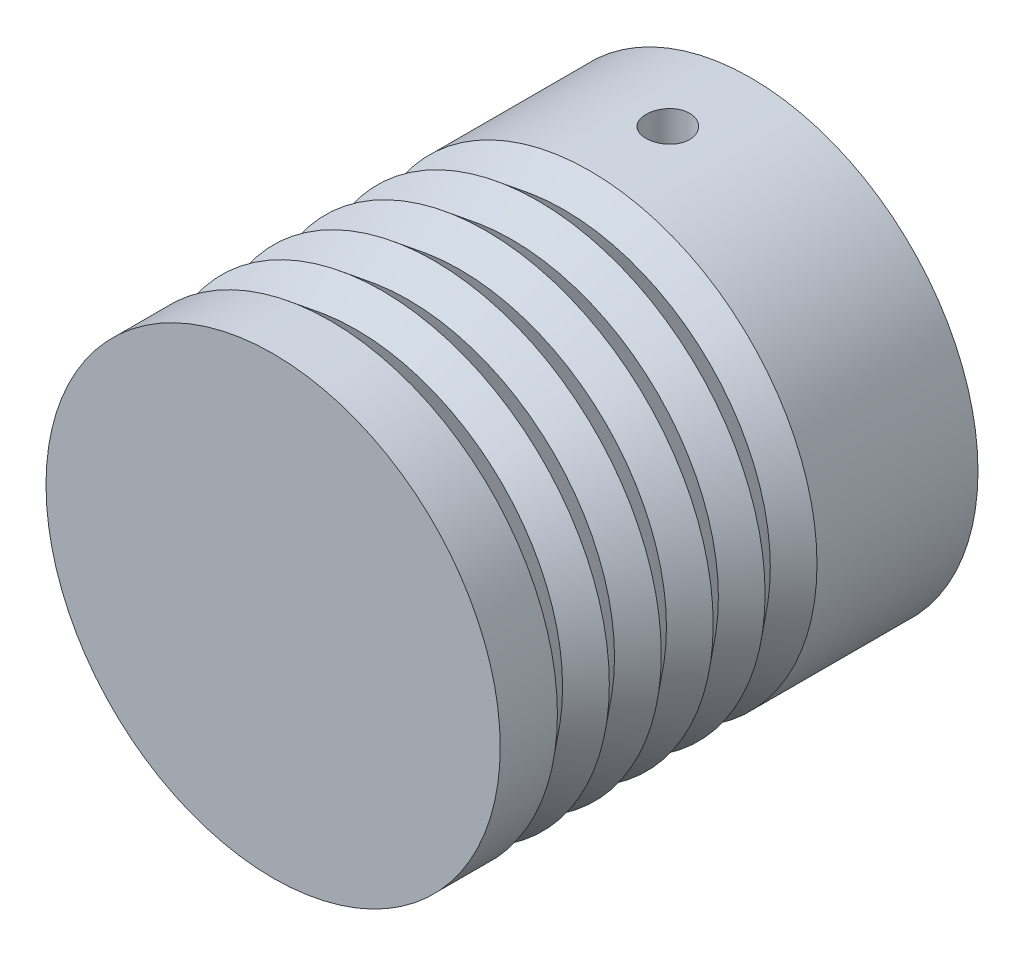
ISO-10303-21;
HEADER;
FILE_DESCRIPTION(('STEP AP214'),'2;1');
FILE_NAME('part.step','',(''),(''),'','','');
FILE_SCHEMA(('AUTOMOTIVE_DESIGN { 1 0 10303 214 1 1 1 1 }'));
ENDSEC;
DATA;
#1=APPLICATION_CONTEXT('core data for automotive mechanical design processes');
#2=APPLICATION_PROTOCOL_DEFINITION('international standard','automotive_design',2000,#1);
#3=PRODUCT_CONTEXT('',#1,'mechanical');
#4=PRODUCT('Part','Part','',(#3));
#5=PRODUCT_RELATED_PRODUCT_CATEGORY('part','',(#4));
#6=PRODUCT_DEFINITION_FORMATION('','',#4);
#7=PRODUCT_DEFINITION_CONTEXT('part definition',#1,'design');
#8=PRODUCT_DEFINITION('design','',#6,#7);
#9=PRODUCT_DEFINITION_SHAPE('','',#8);
#10=(LENGTH_UNIT() NAMED_UNIT(*) SI_UNIT(.MILLI.,.METRE.));
#11=(NAMED_UNIT(*) PLANE_ANGLE_UNIT() SI_UNIT($,.RADIAN.));
#12=(NAMED_UNIT(*) SI_UNIT($,.STERADIAN.) SOLID_ANGLE_UNIT());
#13=UNCERTAINTY_MEASURE_WITH_UNIT(LENGTH_MEASURE(1.E-05),#10,'distance_accuracy_value','');
#14=(GEOMETRIC_REPRESENTATION_CONTEXT(3) GLOBAL_UNCERTAINTY_ASSIGNED_CONTEXT((#13)) GLOBAL_UNIT_ASSIGNED_CONTEXT((#10,
#11,#12)) REPRESENTATION_CONTEXT('',''));
#15=CARTESIAN_POINT('',(0.,0.,0.));
#16=DIRECTION('',(0.,0.,1.));
#17=DIRECTION('',(1.,0.,0.));
#18=AXIS2_PLACEMENT_3D('',#15,#16,#17);
#19=CARTESIAN_POINT('',(2.43215268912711E-05,-1.12921142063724E-06,2.66313744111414));
#20=DIRECTION('',(1.8833914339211E-07,-2.44001352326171E-13,-0.999999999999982));
#21=DIRECTION('',(-0.999999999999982,0.,-1.8833914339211E-07));
#22=AXIS2_PLACEMENT_3D('',#19,#20,#21);
#23=CONICAL_SURFACE('',#22,15.0370018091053,0.674740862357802);
#24=CARTESIAN_POINT('',(2.43215732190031E-05,-1.12921010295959E-06,2.66355047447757));
#25=DIRECTION('',(-1.88342028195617E-07,3.34700908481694E-13,-0.999999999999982));
#26=DIRECTION('',(-0.999999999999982,-2.3657708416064E-13,1.88342028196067E-07));
#27=AXIS2_PLACEMENT_3D('',#24,#25,#26);
#28=CIRCLE('',#27,15.0373276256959);
#29=CARTESIAN_POINT('',(-15.0373033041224,-1.12921366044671E-06,2.66355330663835));
#30=VERTEX_POINT('',#29);
#31=EDGE_CURVE('E12',#30,#30,#28,.T.);
#32=ORIENTED_EDGE('',*,*,#31,.F.);
#33=EDGE_LOOP('',(#32));
#34=FACE_BOUND('',#33,.T.);
#35=CARTESIAN_POINT('',(2.39979061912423E-05,-1.12920194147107E-06,4.38231071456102));
#36=DIRECTION('',(1.88338518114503E-07,-9.4754163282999E-13,0.999999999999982));
#37=DIRECTION('',(0.999999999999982,0.,-1.88338518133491E-07));
#38=AXIS2_PLACEMENT_3D('',#35,#36,#37);
#39=CIRCLE('',#38,13.6623361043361);
#40=CARTESIAN_POINT('',(13.662360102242,-1.12920194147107E-06,4.38230814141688));
#41=VERTEX_POINT('',#40);
#42=EDGE_CURVE('E359',#41,#41,#39,.T.);
#43=ORIENTED_EDGE('',*,*,#42,.F.);
#44=EDGE_LOOP('',(#43));
#45=FACE_BOUND('',#44,.T.);
#46=ADVANCED_FACE('F62',(#34,#45),#23,.T.);
#47=CARTESIAN_POINT('',(2.43215203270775E-05,-1.12921291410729E-06,-0.774362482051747));
#48=DIRECTION('',(1.88339782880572E-07,0.,-0.999999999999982));
#49=DIRECTION('',(-0.999999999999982,0.,-1.88339782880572E-07));
#50=AXIS2_PLACEMENT_3D('',#47,#48,#49);
#51=CONICAL_SURFACE('',#50,15.0370018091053,0.674740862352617);
#52=CARTESIAN_POINT('',(2.43216081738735E-05,-1.12921098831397E-06,-0.773949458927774));
#53=DIRECTION('',(-1.88338717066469E-07,2.6958808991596E-13,-0.999999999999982));
#54=DIRECTION('',(-0.999999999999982,-1.78845486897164E-13,1.88338717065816E-07));
#55=AXIS2_PLACEMENT_3D('',#52,#53,#54);
#56=CIRCLE('',#55,15.0373276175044);
#57=CARTESIAN_POINT('',(-15.0373032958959,-1.12921367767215E-06,-0.773946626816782));
#58=VERTEX_POINT('',#57);
#59=EDGE_CURVE('E88',#58,#58,#56,.T.);
#60=ORIENTED_EDGE('',*,*,#59,.F.);
#61=EDGE_LOOP('',(#60));
#62=FACE_BOUND('',#61,.T.);
#63=CARTESIAN_POINT('',(2.39978622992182E-05,-1.12920952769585E-06,0.944810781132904));
#64=DIRECTION('',(1.88342028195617E-07,-3.34700908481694E-13,0.999999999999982));
#65=DIRECTION('',(0.999999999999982,0.,-1.88342028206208E-07));
#66=AXIS2_PLACEMENT_3D('',#63,#64,#65);
#67=CIRCLE('',#66,13.6623360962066);
#68=CARTESIAN_POINT('',(13.6623600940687,-1.12920952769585E-06,0.944808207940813));
#69=VERTEX_POINT('',#68);
#70=EDGE_CURVE('E168',#69,#69,#67,.T.);
#71=ORIENTED_EDGE('',*,*,#70,.F.);
#72=EDGE_LOOP('',(#71));
#73=FACE_BOUND('',#72,.T.);
#74=ADVANCED_FACE('F123',(#62,#73),#51,.T.);
#75=CARTESIAN_POINT('',(2.43215691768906E-05,-1.12921979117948E-06,-4.21186240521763));
#76=DIRECTION('',(1.88335249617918E-07,5.79273716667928E-13,-0.999999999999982));
#77=DIRECTION('',(-0.999999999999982,0.,-1.88335249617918E-07));
#78=AXIS2_PLACEMENT_3D('',#75,#76,#77);
#79=CONICAL_SURFACE('',#78,15.0370018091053,0.674740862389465);
#80=CARTESIAN_POINT('',(2.43216568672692E-05,-1.12920847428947E-06,-4.21144939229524));
#81=DIRECTION('',(-1.88334198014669E-07,4.8027949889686E-13,-0.999999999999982));
#82=DIRECTION('',(-0.999999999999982,-3.45378940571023E-13,1.88334198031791E-07));
#83=AXIS2_PLACEMENT_3D('',#80,#81,#82);
#84=CIRCLE('',#83,15.0373276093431);
#85=CARTESIAN_POINT('',(-15.037303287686,-1.12921366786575E-06,-4.2114465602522));
#86=VERTEX_POINT('',#85);
#87=EDGE_CURVE('E76',#86,#86,#84,.T.);
#88=ORIENTED_EDGE('',*,*,#87,.F.);
#89=EDGE_LOOP('',(#88));
#90=FACE_BOUND('',#89,.T.);
#91=CARTESIAN_POINT('',(2.39979029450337E-05,-1.12921052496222E-06,-2.49268915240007));
#92=DIRECTION('',(1.88338717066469E-07,-2.6958808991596E-13,0.999999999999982));
#93=DIRECTION('',(0.999999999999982,0.,-1.88338717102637E-07));
#94=AXIS2_PLACEMENT_3D('',#91,#92,#93);
#95=CIRCLE('',#94,13.662336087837);
#96=CARTESIAN_POINT('',(13.6623600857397,-1.12921052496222E-06,-2.49269172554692));
#97=VERTEX_POINT('',#96);
#98=EDGE_CURVE('E322',#97,#97,#95,.T.);
#99=ORIENTED_EDGE('',*,*,#98,.F.);
#100=EDGE_LOOP('',(#99));
#101=FACE_BOUND('',#100,.T.);
#102=ADVANCED_FACE('F129',(#90,#101),#79,.T.);
#103=CARTESIAN_POINT('',(2.43215797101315E-05,-1.12923128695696E-06,-7.64936232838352));
#104=DIRECTION('',(1.88334283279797E-07,1.62908434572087E-12,-0.999999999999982));
#105=DIRECTION('',(-0.999999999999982,0.,-1.88334283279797E-07));
#106=AXIS2_PLACEMENT_3D('',#103,#104,#105);
#107=CONICAL_SURFACE('',#106,15.0370018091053,0.674740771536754);
#108=CARTESIAN_POINT('',(2.63656765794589E-05,-1.12921349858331E-06,-7.64747821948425));
#109=DIRECTION('',(0.,0.,-1.));
#110=DIRECTION('',(-1.,0.,0.));
#111=AXIS2_PLACEMENT_3D('',#108,#109,#110);
#112=CIRCLE('',#111,15.0344251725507);
#113=CARTESIAN_POINT('',(-15.0343988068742,-1.12921367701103E-06,-7.64747821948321));
#114=VERTEX_POINT('',#113);
#115=EDGE_CURVE('E94',#114,#114,#112,.T.);
#116=ORIENTED_EDGE('',*,*,#115,.F.);
#117=EDGE_LOOP('',(#116));
#118=FACE_BOUND('',#117,.T.);
#119=CARTESIAN_POINT('',(2.39979594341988E-05,-1.1292076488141E-06,-5.9301889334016));
#120=DIRECTION('',(1.88334198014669E-07,-4.8027949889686E-13,0.999999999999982));
#121=DIRECTION('',(0.999999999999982,0.,-1.88334198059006E-07));
#122=AXIS2_PLACEMENT_3D('',#119,#120,#121);
#123=CIRCLE('',#122,13.6623362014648);
#124=CARTESIAN_POINT('',(13.662360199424,-1.1292076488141E-06,-5.93019150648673));
#125=VERTEX_POINT('',#124);
#126=EDGE_CURVE('E220',#125,#125,#123,.T.);
#127=ORIENTED_EDGE('',*,*,#126,.F.);
#128=EDGE_LOOP('',(#127));
#129=FACE_BOUND('',#128,.T.);
#130=ADVANCED_FACE('F192',(#118,#129),#107,.T.);
#131=CARTESIAN_POINT('',(2.43216424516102E-05,-1.12922691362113E-06,6.10063736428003));
#132=DIRECTION('',(1.883284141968E-07,1.26504893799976E-12,-0.999999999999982));
#133=DIRECTION('',(-0.999999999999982,0.,-1.883284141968E-07));
#134=AXIS2_PLACEMENT_3D('',#131,#132,#133);
#135=CONICAL_SURFACE('',#134,15.0370018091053,0.674740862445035);
#136=CARTESIAN_POINT('',(2.39975932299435E-05,-1.12922616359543E-06,7.81981052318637));
#137=DIRECTION('',(1.88363657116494E-07,9.97680453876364E-13,0.999999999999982));
#138=DIRECTION('',(0.999999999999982,0.,-1.88363657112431E-07));
#139=AXIS2_PLACEMENT_3D('',#136,#137,#138);
#140=CIRCLE('',#139,13.6623362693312);
#141=CARTESIAN_POINT('',(13.6623602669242,-1.12922616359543E-06,7.81980794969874));
#142=VERTEX_POINT('',#141);
#143=EDGE_CURVE('E233',#142,#142,#140,.T.);
#144=ORIENTED_EDGE('',*,*,#143,.F.);
#145=EDGE_LOOP('',(#144));
#146=FACE_BOUND('',#145,.T.);
#147=CARTESIAN_POINT('',(2.43216110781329E-05,-1.12920357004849E-06,6.10105040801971));
#148=DIRECTION('',(-1.88338518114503E-07,9.4754163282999E-13,-0.999999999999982));
#149=DIRECTION('',(-0.999999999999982,-6.71784509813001E-13,1.88338518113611E-07));
#150=AXIS2_PLACEMENT_3D('',#147,#148,#149);
#151=CIRCLE('',#150,15.0373276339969);
#152=CARTESIAN_POINT('',(-15.0373033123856,-1.12921367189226E-06,6.10105324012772));
#153=VERTEX_POINT('',#152);
#154=EDGE_CURVE('E371',#153,#153,#151,.T.);
#155=ORIENTED_EDGE('',*,*,#154,.F.);
#156=EDGE_LOOP('',(#155));
#157=FACE_BOUND('',#156,.T.);
#158=ADVANCED_FACE('F239',(#146,#157),#135,.T.);
#159=CARTESIAN_POINT('',(2.63656760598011E-05,-1.12921342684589E-06,13.3193898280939));
#160=DIRECTION('',(0.,0.,-1.));
#161=DIRECTION('',(0.,1.,0.));
#162=AXIS2_PLACEMENT_3D('',#159,#160,#161);
#163=CYLINDRICAL_SURFACE('',#162,15.0344251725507);
#164=CARTESIAN_POINT('',(2.43209091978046E-05,-1.12922445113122E-06,9.53625610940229));
#165=DIRECTION('',(-1.88363657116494E-07,-9.97680453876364E-13,-0.999999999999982));
#166=DIRECTION('',(0.999999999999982,7.16800836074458E-13,-1.88363657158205E-07));
#167=AXIS2_PLACEMENT_3D('',#164,#165,#166);
#168=CIRCLE('',#167,15.0354922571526);
#169=CARTESIAN_POINT('',(15.0355165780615,-1.1292136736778E-06,9.53625327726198));
#170=VERTEX_POINT('',#169);
#171=EDGE_CURVE('E265',#170,#170,#168,.T.);
#172=ORIENTED_EDGE('',*,*,#171,.F.);
#173=EDGE_LOOP('',(#172));
#174=FACE_BOUND('',#173,.T.);
#175=CARTESIAN_POINT('',(2.63656760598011E-05,-1.12921342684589E-06,13.3193898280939));
#176=DIRECTION('',(0.,0.,1.));
#177=DIRECTION('',(1.,0.,0.));
#178=AXIS2_PLACEMENT_3D('',#175,#176,#177);
#179=CIRCLE('',#178,15.0344251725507);
#180=CARTESIAN_POINT('',(15.0344515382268,-1.12921342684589E-06,13.3193898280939));
#181=VERTEX_POINT('',#180);
#182=EDGE_CURVE('E82',#181,#181,#179,.F.);
#183=ORIENTED_EDGE('',*,*,#182,.T.);
#184=EDGE_LOOP('',(#183));
#185=FACE_BOUND('',#184,.T.);
#186=ADVANCED_FACE('F248',(#174,#185),#163,.T.);
#187=CARTESIAN_POINT('',(2.63656763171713E-05,-1.12921367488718E-06,-11.4306091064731));
#188=DIRECTION('',(0.,0.,1.));
#189=DIRECTION('',(1.,0.,0.));
#190=AXIS2_PLACEMENT_3D('',#187,#188,#189);
#191=CYLINDRICAL_SURFACE('',#190,15.0344251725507);
#192=CARTESIAN_POINT('',(2.63656761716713E-05,-15.0344263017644,-11.3618591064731));
#193=CARTESIAN_POINT('',(-0.0808698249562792,-15.0344254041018,-11.3618626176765));
#194=CARTESIAN_POINT('',(-0.161819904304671,-15.0337664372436,-11.3686811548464));
#195=CARTESIAN_POINT('',(-0.321476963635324,-15.031201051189,-11.3957793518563));
#196=CARTESIAN_POINT('',(-0.400181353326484,-15.0292932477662,-11.4160739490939));
#197=CARTESIAN_POINT('',(-0.553011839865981,-15.0244456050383,-11.4695290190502));
#198=CARTESIAN_POINT('',(-0.627140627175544,-15.0215063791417,-11.5026818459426));
#199=CARTESIAN_POINT('',(-0.768764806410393,-15.0149247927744,-11.5808977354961));
#200=CARTESIAN_POINT('',(-0.836261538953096,-15.0112825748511,-11.6259583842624));
#201=CARTESIAN_POINT('',(-0.962947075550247,-15.0036896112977,-11.726872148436));
#202=CARTESIAN_POINT('',(-1.02211069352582,-14.9997379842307,-11.7827568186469));
#203=CARTESIAN_POINT('',(-1.13023417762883,-14.9919788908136,-11.9036650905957));
#204=CARTESIAN_POINT('',(-1.17919357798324,-14.9881714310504,-11.9686891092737));
#205=CARTESIAN_POINT('',(-1.26560715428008,-14.9811226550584,-12.1061867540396));
#206=CARTESIAN_POINT('',(-1.30303868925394,-14.9778824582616,-12.1786746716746));
#207=CARTESIAN_POINT('',(-1.36518941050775,-14.9723458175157,-12.328943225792));
#208=CARTESIAN_POINT('',(-1.38990888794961,-14.9700493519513,-12.4067237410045));
#209=CARTESIAN_POINT('',(-1.42585949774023,-14.9666680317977,-12.5651137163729));
#210=CARTESIAN_POINT('',(-1.43713223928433,-14.9655794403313,-12.645713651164));
#211=CARTESIAN_POINT('',(-1.44599798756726,-14.9647254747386,-12.8076683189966));
#212=CARTESIAN_POINT('',(-1.44359132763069,-14.9649600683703,-12.8890230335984));
#213=CARTESIAN_POINT('',(-1.42520090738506,-14.966722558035,-13.0498915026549));
#214=CARTESIAN_POINT('',(-1.40926252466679,-14.9682461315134,-13.129410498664));
#215=CARTESIAN_POINT('',(-1.36433167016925,-14.9724081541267,-13.2846395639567));
#216=CARTESIAN_POINT('',(-1.33533903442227,-14.9750466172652,-13.3603495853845));
#217=CARTESIAN_POINT('',(-1.26507239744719,-14.9811461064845,-13.5059552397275));
#218=CARTESIAN_POINT('',(-1.22377820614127,-14.9846084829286,-13.5758410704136));
#219=CARTESIAN_POINT('',(-1.13009516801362,-14.9919645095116,-13.707707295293));
#220=CARTESIAN_POINT('',(-1.07770602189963,-14.9958581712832,-13.7696874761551));
#221=CARTESIAN_POINT('',(-0.963066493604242,-15.0036573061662,-13.8842467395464));
#222=CARTESIAN_POINT('',(-0.900776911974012,-15.0075627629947,-13.9367866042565));
#223=CARTESIAN_POINT('',(-0.768240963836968,-15.014930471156,-14.0306700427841));
#224=CARTESIAN_POINT('',(-0.697994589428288,-15.0183927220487,-14.0720136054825));
#225=CARTESIAN_POINT('',(-0.55151234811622,-15.0244849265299,-14.1423290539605));
#226=CARTESIAN_POINT('',(-0.475275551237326,-15.0271147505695,-14.1712990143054));
#227=CARTESIAN_POINT('',(-0.318989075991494,-15.0312444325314,-14.2160164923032));
#228=CARTESIAN_POINT('',(-0.238939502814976,-15.0327443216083,-14.2317643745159));
#229=CARTESIAN_POINT('',(-0.0776394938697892,-15.0344411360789,-14.2495410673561));
#230=CARTESIAN_POINT('',(0.00360492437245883,-15.0346432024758,-14.2516240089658));
#231=CARTESIAN_POINT('',(0.16528672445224,-15.0337353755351,-14.242153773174));
#232=CARTESIAN_POINT('',(0.245724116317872,-15.0326254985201,-14.2306007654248));
#233=CARTESIAN_POINT('',(0.403352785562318,-15.0292218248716,-14.1942314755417));
#234=CARTESIAN_POINT('',(0.480549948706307,-15.0269302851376,-14.1694404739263));
#235=CARTESIAN_POINT('',(0.629689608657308,-15.0214204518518,-14.1073248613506));
#236=CARTESIAN_POINT('',(0.701631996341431,-15.0182021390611,-14.0699999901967));
#237=CARTESIAN_POINT('',(0.838465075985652,-15.0111861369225,-13.9837414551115));
#238=CARTESIAN_POINT('',(0.903333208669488,-15.0073866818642,-13.9347721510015));
#239=CARTESIAN_POINT('',(1.0239482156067,-14.9996405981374,-13.826666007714));
#240=CARTESIAN_POINT('',(1.07969487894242,-14.9956939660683,-13.7675289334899));
#241=CARTESIAN_POINT('',(1.18067187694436,-14.988082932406,-13.6405300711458));
#242=CARTESIAN_POINT('',(1.2258667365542,-14.9844195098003,-13.5726400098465));
#243=CARTESIAN_POINT('',(1.30421350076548,-14.9778043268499,-13.4302020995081));
#244=CARTESIAN_POINT('',(1.33736555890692,-14.9748525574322,-13.3556543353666));
#245=CARTESIAN_POINT('',(1.39062600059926,-14.9700008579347,-13.2021398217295));
#246=CARTESIAN_POINT('',(1.41075564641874,-14.9680992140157,-13.1231805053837));
#247=CARTESIAN_POINT('',(1.43746890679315,-14.9655576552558,-12.962983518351));
#248=CARTESIAN_POINT('',(1.4440528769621,-14.9649177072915,-12.8817459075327));
#249=CARTESIAN_POINT('',(1.4434831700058,-14.9649726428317,-12.7196509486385));
#250=CARTESIAN_POINT('',(1.43638522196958,-14.96566211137,-12.6387933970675));
#251=CARTESIAN_POINT('',(1.40876984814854,-14.9682866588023,-12.4794248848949));
#252=CARTESIAN_POINT('',(1.3882524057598,-14.9702217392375,-12.4009139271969));
#253=CARTESIAN_POINT('',(1.33439552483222,-14.9751179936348,-12.2484666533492));
#254=CARTESIAN_POINT('',(1.30105756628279,-14.9780790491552,-12.1745298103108));
#255=CARTESIAN_POINT('',(1.22251184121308,-14.9846938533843,-12.033292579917));
#256=CARTESIAN_POINT('',(1.17730417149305,-14.9883475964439,-11.9659921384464));
#257=CARTESIAN_POINT('',(1.07609287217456,-14.9959538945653,-11.8396525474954));
#258=CARTESIAN_POINT('',(1.02004775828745,-14.9999075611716,-11.7806466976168));
#259=CARTESIAN_POINT('',(0.898833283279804,-15.0076580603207,-11.6728518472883));
#260=CARTESIAN_POINT('',(0.833661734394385,-15.0114548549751,-11.6240653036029));
#261=CARTESIAN_POINT('',(0.695878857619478,-15.0184729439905,-11.5380054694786));
#262=CARTESIAN_POINT('',(0.623250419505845,-15.0216928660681,-11.5007594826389));
#263=CARTESIAN_POINT('',(0.472786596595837,-15.0271792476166,-11.4390406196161));
#264=CARTESIAN_POINT('',(0.394957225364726,-15.0294467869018,-11.4145532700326));
#265=CARTESIAN_POINT('',(0.263906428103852,-15.0321999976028,-11.3851860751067));
#266=CARTESIAN_POINT('',(0.211524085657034,-15.0330309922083,-11.3764503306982));
#267=CARTESIAN_POINT('',(0.106111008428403,-15.0341444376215,-11.3647857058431));
#268=CARTESIAN_POINT('',(0.0530802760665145,-15.0344268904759,-11.3618568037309));
#269=CARTESIAN_POINT('',(2.63656761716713E-05,-15.0344263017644,-11.3618591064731));
#270=B_SPLINE_CURVE_WITH_KNOTS('',3,(#192,#193,#194,#195,#196,#197,#198,#199,#200,#201,#202,
#203,#204,#205,#206,#207,#208,#209,#210,#211,#212,#213,#214,#215,#216,#217,#218,#219,#220,#221,
#222,#223,#224,#225,#226,#227,#228,#229,#230,#231,#232,#233,#234,#235,#236,#237,#238,#239,#240,
#241,#242,#243,#244,#245,#246,#247,#248,#249,#250,#251,#252,#253,#254,#255,#256,#257,#258,#259,
#260,#261,#262,#263,#264,#265,#266,#267,#268,#269),.UNSPECIFIED.,.T.,.F.,(4,2,2,2,2,2,2,2,2,2,2,
2,2,2,2,2,2,2,2,2,2,2,2,2,2,2,2,2,2,2,2,2,2,2,2,2,2,2,4),(0.,0.242494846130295,
0.485258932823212,0.727878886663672,0.970449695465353,1.2137386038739,1.45703861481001,
1.70081346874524,1.94458273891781,2.18759572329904,2.43060278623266,2.672798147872,
2.9149965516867,3.15759467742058,3.40019934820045,3.64378967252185,3.88738023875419,
4.13100869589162,4.37463043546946,4.61728652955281,4.85993960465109,5.10213093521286,
5.3443272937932,5.58727470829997,5.83022773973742,6.0739861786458,6.3177415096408,
6.56109783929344,6.80444778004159,7.04680860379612,7.28916972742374,7.53150288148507,
7.77383405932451,8.017111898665,8.26044815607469,8.50435579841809,8.74798614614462,
8.90702142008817,9.06605610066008),.UNSPECIFIED.);
#271=CARTESIAN_POINT('',(2.63656761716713E-05,-15.0344263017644,-11.3618591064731));
#272=VERTEX_POINT('',#271);
#273=EDGE_CURVE('E405',#272,#272,#270,.T.);
#274=ORIENTED_EDGE('',*,*,#273,.F.);
#275=EDGE_LOOP('',(#274));
#276=FACE_BOUND('',#275,.T.);
#277=CARTESIAN_POINT('',(2.63656761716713E-05,15.0344240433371,-11.3618591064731));
#278=CARTESIAN_POINT('',(0.080922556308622,15.0344231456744,-11.3618626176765));
#279=CARTESIAN_POINT('',(0.161872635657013,15.0337641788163,-11.3686811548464));
#280=CARTESIAN_POINT('',(0.321529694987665,15.0311987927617,-11.3957793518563));
#281=CARTESIAN_POINT('',(0.400234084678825,15.0292909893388,-11.4160739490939));
#282=CARTESIAN_POINT('',(0.553064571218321,15.0244433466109,-11.4695290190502));
#283=CARTESIAN_POINT('',(0.627193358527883,15.0215041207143,-11.5026818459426));
#284=CARTESIAN_POINT('',(0.768817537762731,15.014922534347,-11.5808977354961));
#285=CARTESIAN_POINT('',(0.836314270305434,15.0112803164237,-11.6259583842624));
#286=CARTESIAN_POINT('',(0.962999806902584,15.0036873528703,-11.726872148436));
#287=CARTESIAN_POINT('',(1.02216342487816,14.9997357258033,-11.7827568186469));
#288=CARTESIAN_POINT('',(1.13028690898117,14.9919766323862,-11.9036650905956));
#289=CARTESIAN_POINT('',(1.17924630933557,14.988169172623,-11.9686891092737));
#290=CARTESIAN_POINT('',(1.26565988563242,14.9811203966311,-12.1061867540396));
#291=CARTESIAN_POINT('',(1.30309142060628,14.9778801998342,-12.1786746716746));
#292=CARTESIAN_POINT('',(1.36524214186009,14.9723435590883,-12.328943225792));
#293=CARTESIAN_POINT('',(1.38996161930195,14.9700470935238,-12.4067237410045));
#294=CARTESIAN_POINT('',(1.42591222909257,14.9666657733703,-12.5651137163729));
#295=CARTESIAN_POINT('',(1.43718497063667,14.9655771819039,-12.6457136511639));
#296=CARTESIAN_POINT('',(1.4460507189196,14.9647232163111,-12.8076683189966));
#297=CARTESIAN_POINT('',(1.44364405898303,14.9649578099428,-12.8890230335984));
#298=CARTESIAN_POINT('',(1.4252536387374,14.9667202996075,-13.0498915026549));
#299=CARTESIAN_POINT('',(1.40931525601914,14.9682438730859,-13.129410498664));
#300=CARTESIAN_POINT('',(1.3643844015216,14.9724058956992,-13.2846395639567));
#301=CARTESIAN_POINT('',(1.33539176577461,14.9750443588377,-13.3603495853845));
#302=CARTESIAN_POINT('',(1.26512512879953,14.9811438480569,-13.5059552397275));
#303=CARTESIAN_POINT('',(1.22383093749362,14.9846062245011,-13.5758410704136));
#304=CARTESIAN_POINT('',(1.13014789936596,14.991962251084,-13.707707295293));
#305=CARTESIAN_POINT('',(1.07775875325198,14.9958559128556,-13.7696874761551));
#306=CARTESIAN_POINT('',(0.963119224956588,15.0036550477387,-13.8842467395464));
#307=CARTESIAN_POINT('',(0.900829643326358,15.0075605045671,-13.9367866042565));
#308=CARTESIAN_POINT('',(0.768293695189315,15.0149282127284,-14.0306700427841));
#309=CARTESIAN_POINT('',(0.698047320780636,15.0183904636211,-14.0720136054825));
#310=CARTESIAN_POINT('',(0.551565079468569,15.0244826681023,-14.1423290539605));
#311=CARTESIAN_POINT('',(0.475328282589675,15.0271124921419,-14.1712990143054));
#312=CARTESIAN_POINT('',(0.319041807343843,15.0312421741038,-14.2160164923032));
#313=CARTESIAN_POINT('',(0.238992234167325,15.0327420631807,-14.2317643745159));
#314=CARTESIAN_POINT('',(0.0776922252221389,15.0344388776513,-14.2495410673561));
#315=CARTESIAN_POINT('',(-0.00355219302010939,15.0346409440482,-14.2516240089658));
#316=CARTESIAN_POINT('',(-0.165233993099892,15.0337331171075,-14.242153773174));
#317=CARTESIAN_POINT('',(-0.245671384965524,15.0326232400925,-14.2306007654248));
#318=CARTESIAN_POINT('',(-0.403300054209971,15.029219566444,-14.1942314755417));
#319=CARTESIAN_POINT('',(-0.48049721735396,15.02692802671,-14.1694404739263));
#320=CARTESIAN_POINT('',(-0.629636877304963,15.0214181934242,-14.1073248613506));
#321=CARTESIAN_POINT('',(-0.701579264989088,15.0181998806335,-14.0699999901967));
#322=CARTESIAN_POINT('',(-0.83841234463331,15.0111838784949,-13.9837414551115));
#323=CARTESIAN_POINT('',(-0.903280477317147,15.0073844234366,-13.9347721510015));
#324=CARTESIAN_POINT('',(-1.02389548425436,14.9996383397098,-13.826666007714));
#325=CARTESIAN_POINT('',(-1.07964214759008,14.9956917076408,-13.7675289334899));
#326=CARTESIAN_POINT('',(-1.18061914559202,14.9880806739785,-13.6405300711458));
#327=CARTESIAN_POINT('',(-1.22581400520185,14.9844172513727,-13.5726400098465));
#328=CARTESIAN_POINT('',(-1.30416076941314,14.9778020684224,-13.4302020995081));
#329=CARTESIAN_POINT('',(-1.33731282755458,14.9748502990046,-13.3556543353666));
#330=CARTESIAN_POINT('',(-1.39057326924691,14.9699985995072,-13.2021398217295));
#331=CARTESIAN_POINT('',(-1.4107029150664,14.9680969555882,-13.1231805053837));
#332=CARTESIAN_POINT('',(-1.43741617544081,14.9655553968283,-12.962983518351));
#333=CARTESIAN_POINT('',(-1.44400014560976,14.964915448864,-12.8817459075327));
#334=CARTESIAN_POINT('',(-1.44343043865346,14.9649703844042,-12.7196509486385));
#335=CARTESIAN_POINT('',(-1.43633249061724,14.9656598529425,-12.6387933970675));
#336=CARTESIAN_POINT('',(-1.40871711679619,14.9682844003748,-12.4794248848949));
#337=CARTESIAN_POINT('',(-1.38819967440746,14.97021948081,-12.4009139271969));
#338=CARTESIAN_POINT('',(-1.33434279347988,14.9751157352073,-12.2484666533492));
#339=CARTESIAN_POINT('',(-1.30100483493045,14.9780767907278,-12.1745298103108));
#340=CARTESIAN_POINT('',(-1.22245910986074,14.9846915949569,-12.033292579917));
#341=CARTESIAN_POINT('',(-1.17725144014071,14.9883453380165,-11.9659921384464));
#342=CARTESIAN_POINT('',(-1.07604014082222,14.9959516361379,-11.8396525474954));
#343=CARTESIAN_POINT('',(-1.01999502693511,14.9999053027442,-11.7806466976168));
#344=CARTESIAN_POINT('',(-0.898780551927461,15.0076558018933,-11.6728518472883));
#345=CARTESIAN_POINT('',(-0.833609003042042,15.0114525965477,-11.6240653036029));
#346=CARTESIAN_POINT('',(-0.695826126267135,15.0184706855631,-11.5380054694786));
#347=CARTESIAN_POINT('',(-0.623197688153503,15.0216906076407,-11.5007594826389));
#348=CARTESIAN_POINT('',(-0.472733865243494,15.0271769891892,-11.4390406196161));
#349=CARTESIAN_POINT('',(-0.394904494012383,15.0294445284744,-11.4145532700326));
#350=CARTESIAN_POINT('',(-0.263853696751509,15.0321977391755,-11.3851860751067));
#351=CARTESIAN_POINT('',(-0.211471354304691,15.0330287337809,-11.3764503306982));
#352=CARTESIAN_POINT('',(-0.106058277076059,15.0341421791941,-11.3647857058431));
#353=CARTESIAN_POINT('',(-0.0530275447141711,15.0344246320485,-11.3618568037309));
#354=CARTESIAN_POINT('',(2.63656761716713E-05,15.0344240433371,-11.3618591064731));
#355=B_SPLINE_CURVE_WITH_KNOTS('',3,(#277,#278,#279,#280,#281,#282,#283,#284,#285,#286,#287,
#288,#289,#290,#291,#292,#293,#294,#295,#296,#297,#298,#299,#300,#301,#302,#303,#304,#305,#306,
#307,#308,#309,#310,#311,#312,#313,#314,#315,#316,#317,#318,#319,#320,#321,#322,#323,#324,#325,
#326,#327,#328,#329,#330,#331,#332,#333,#334,#335,#336,#337,#338,#339,#340,#341,#342,#343,#344,
#345,#346,#347,#348,#349,#350,#351,#352,#353,#354),.UNSPECIFIED.,.T.,.F.,(4,2,2,2,2,2,2,2,2,2,2,
2,2,2,2,2,2,2,2,2,2,2,2,2,2,2,2,2,2,2,2,2,2,2,2,2,2,2,4),(0.,0.242494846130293,
0.485258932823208,0.727878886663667,0.970449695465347,1.2137386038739,1.45703861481,
1.70081346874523,1.9445827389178,2.18759572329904,2.43060278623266,2.672798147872,
2.91499655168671,3.15759467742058,3.40019934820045,3.64378967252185,3.88738023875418,
4.13100869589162,4.37463043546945,4.6172865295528,4.85993960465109,5.10213093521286,
5.3443272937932,5.58727470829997,5.83022773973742,6.0739861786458,6.3177415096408,
6.56109783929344,6.80444778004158,7.04680860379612,7.28916972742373,7.53150288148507,
7.77383405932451,8.017111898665,8.26044815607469,8.50435579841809,8.74798614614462,
8.90702142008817,9.06605610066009),.UNSPECIFIED.);
#356=CARTESIAN_POINT('',(2.63656761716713E-05,15.0344240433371,-11.3618591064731));
#357=VERTEX_POINT('',#356);
#358=EDGE_CURVE('E398',#357,#357,#355,.T.);
#359=ORIENTED_EDGE('',*,*,#358,.F.);
#360=EDGE_LOOP('',(#359));
#361=FACE_BOUND('',#360,.T.);
#362=ORIENTED_EDGE('',*,*,#115,.T.);
#363=EDGE_LOOP('',(#362));
#364=FACE_BOUND('',#363,.T.);
#365=CARTESIAN_POINT('',(2.63656761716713E-05,-1.129213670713E-06,-18.3056091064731));
#366=DIRECTION('',(0.,0.,-1.));
#367=DIRECTION('',(-1.,0.,0.));
#368=AXIS2_PLACEMENT_3D('',#365,#366,#367);
#369=CIRCLE('',#368,15.0344251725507);
#370=CARTESIAN_POINT('',(-15.0343988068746,-1.129213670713E-06,-18.3056091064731));
#371=VERTEX_POINT('',#370);
#372=EDGE_CURVE('E441',#371,#371,#369,.T.);
#373=ORIENTED_EDGE('',*,*,#372,.F.);
#374=EDGE_LOOP('',(#373));
#375=FACE_BOUND('',#374,.T.);
#376=ADVANCED_FACE('F391',(#276,#361,#364,#375),#191,.T.);
#377=CARTESIAN_POINT('',(2.43212646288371E-05,-1.12922444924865E-06,9.53814305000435));
#378=DIRECTION('',(1.88363657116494E-07,9.97680453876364E-13,0.999999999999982));
#379=DIRECTION('',(0.999999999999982,0.,-1.88363657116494E-07));
#380=AXIS2_PLACEMENT_3D('',#377,#378,#379);
#381=CONICAL_SURFACE('',#380,15.0370018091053,0.674740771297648);
#382=ORIENTED_EDGE('',*,*,#171,.T.);
#383=EDGE_LOOP('',(#382));
#384=FACE_BOUND('',#383,.T.);
#385=ORIENTED_EDGE('',*,*,#143,.T.);
#386=EDGE_LOOP('',(#385));
#387=FACE_BOUND('',#386,.T.);
#388=ADVANCED_FACE('F249',(#384,#387),#381,.T.);
#389=CARTESIAN_POINT('',(2.43214965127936E-05,-1.12921010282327E-06,2.66314320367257));
#390=DIRECTION('',(1.88342028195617E-07,-3.34700908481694E-13,0.999999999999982));
#391=DIRECTION('',(0.999999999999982,0.,-1.88342028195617E-07));
#392=AXIS2_PLACEMENT_3D('',#389,#390,#391);
#393=CONICAL_SURFACE('',#392,15.0370018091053,0.674740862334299);
#394=ORIENTED_EDGE('',*,*,#31,.T.);
#395=EDGE_LOOP('',(#394));
#396=FACE_BOUND('',#395,.T.);
#397=ORIENTED_EDGE('',*,*,#70,.T.);
#398=EDGE_LOOP('',(#397));
#399=FACE_BOUND('',#398,.T.);
#400=ADVANCED_FACE('F288',(#396,#399),#393,.T.);
#401=CARTESIAN_POINT('',(2.43215314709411E-05,-1.12921098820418E-06,-0.774356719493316));
#402=DIRECTION('',(1.88338717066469E-07,-2.6958808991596E-13,0.999999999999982));
#403=DIRECTION('',(0.999999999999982,0.,-1.88338717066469E-07));
#404=AXIS2_PLACEMENT_3D('',#401,#402,#403);
#405=CONICAL_SURFACE('',#404,15.0370018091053,0.67474086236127);
#406=ORIENTED_EDGE('',*,*,#59,.T.);
#407=EDGE_LOOP('',(#406));
#408=FACE_BOUND('',#407,.T.);
#409=ORIENTED_EDGE('',*,*,#98,.T.);
#410=EDGE_LOOP('',(#409));
#411=FACE_BOUND('',#410,.T.);
#412=ADVANCED_FACE('F297',(#408,#411),#405,.T.);
#413=CARTESIAN_POINT('',(2.43215801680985E-05,-1.12920847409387E-06,-4.2118566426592));
#414=DIRECTION('',(1.88334198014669E-07,-4.8027949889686E-13,0.999999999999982));
#415=DIRECTION('',(0.999999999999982,0.,-1.88334198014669E-07));
#416=AXIS2_PLACEMENT_3D('',#413,#414,#415);
#417=CONICAL_SURFACE('',#416,15.0370018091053,0.674740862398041);
#418=ORIENTED_EDGE('',*,*,#87,.T.);
#419=EDGE_LOOP('',(#418));
#420=FACE_BOUND('',#419,.T.);
#421=ORIENTED_EDGE('',*,*,#126,.T.);
#422=EDGE_LOOP('',(#421));
#423=FACE_BOUND('',#422,.T.);
#424=ADVANCED_FACE('F335',(#420,#423),#417,.T.);
#425=CARTESIAN_POINT('',(2.43215343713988E-05,-1.12920356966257E-06,6.10064312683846));
#426=DIRECTION('',(1.88338518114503E-07,-9.4754163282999E-13,0.999999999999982));
#427=DIRECTION('',(0.999999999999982,0.,-1.88338518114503E-07));
#428=AXIS2_PLACEMENT_3D('',#425,#426,#427);
#429=CONICAL_SURFACE('',#428,15.0370018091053,0.674740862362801);
#430=ORIENTED_EDGE('',*,*,#42,.T.);
#431=EDGE_LOOP('',(#430));
#432=FACE_BOUND('',#431,.T.);
#433=ORIENTED_EDGE('',*,*,#154,.T.);
#434=EDGE_LOOP('',(#433));
#435=FACE_BOUND('',#434,.T.);
#436=ADVANCED_FACE('F344',(#432,#435),#429,.T.);
#437=CARTESIAN_POINT('',(2.63656761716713E-05,-1.129213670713E-06,13.3193898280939));
#438=DIRECTION('',(0.,0.,1.));
#439=DIRECTION('',(1.,0.,0.));
#440=AXIS2_PLACEMENT_3D('',#437,#438,#439);
#441=PLANE('',#440);
#442=ORIENTED_EDGE('',*,*,#182,.F.);
#443=EDGE_LOOP('',(#442));
#444=FACE_BOUND('',#443,.T.);
#445=ADVANCED_FACE('F64',(#444),#441,.T.);
#446=CARTESIAN_POINT('',(2.63656761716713E-05,-1.129213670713E-06,-18.3056091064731));
#447=DIRECTION('',(0.,0.,-1.));
#448=DIRECTION('',(-1.,0.,0.));
#449=AXIS2_PLACEMENT_3D('',#446,#447,#448);
#450=PLANE('',#449);
#451=CARTESIAN_POINT('',(2.63656761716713E-05,-1.129213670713E-06,-18.3056091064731));
#452=DIRECTION('',(0.,0.,-1.));
#453=DIRECTION('',(-1.,0.,0.));
#454=AXIS2_PLACEMENT_3D('',#451,#452,#453);
#455=CIRCLE('',#454,2.53);
#456=CARTESIAN_POINT('',(-2.52997363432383,-1.129213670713E-06,-18.3056091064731));
#457=VERTEX_POINT('',#456);
#458=EDGE_CURVE('E407',#457,#457,#455,.T.);
#459=ORIENTED_EDGE('',*,*,#458,.F.);
#460=EDGE_LOOP('',(#459));
#461=FACE_BOUND('',#460,.T.);
#462=ORIENTED_EDGE('',*,*,#372,.T.);
#463=EDGE_LOOP('',(#462));
#464=FACE_BOUND('',#463,.T.);
#465=ADVANCED_FACE('F135',(#461,#464),#450,.T.);
#466=CARTESIAN_POINT('',(2.63656761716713E-05,-20.6250011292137,-12.8056091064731));
#467=DIRECTION('',(0.,1.,0.));
#468=DIRECTION('',(0.,0.,1.));
#469=AXIS2_PLACEMENT_3D('',#466,#467,#468);
#470=CYLINDRICAL_SURFACE('',#469,1.44375);
#471=ORIENTED_EDGE('',*,*,#358,.T.);
#472=EDGE_LOOP('',(#471));
#473=FACE_BOUND('',#472,.T.);
#474=CARTESIAN_POINT('',(2.63656761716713E-05,2.52999887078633,-11.3618591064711));
#475=CARTESIAN_POINT('',(0.0744930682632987,2.52999118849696,-11.3618679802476));
#476=CARTESIAN_POINT('',(0.149068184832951,2.52667455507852,-11.3676599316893));
#477=CARTESIAN_POINT('',(0.296010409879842,2.51371524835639,-11.3905583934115));
#478=CARTESIAN_POINT('',(0.368371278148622,2.50405616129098,-11.4076942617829));
#479=CARTESIAN_POINT('',(0.508438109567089,2.47940401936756,-11.4523507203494));
#480=CARTESIAN_POINT('',(0.57616442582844,2.46443634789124,-11.4798219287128));
#481=CARTESIAN_POINT('',(0.705865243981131,2.43047049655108,-11.544082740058));
#482=CARTESIAN_POINT('',(0.7678413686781,2.41147345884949,-11.5808697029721));
#483=CARTESIAN_POINT('',(0.889339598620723,2.36948087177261,-11.6656901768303));
#484=CARTESIAN_POINT('',(0.948362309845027,2.3462957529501,-11.7143434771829));
#485=CARTESIAN_POINT('',(1.05789585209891,2.29899420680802,-11.8201474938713));
#486=CARTESIAN_POINT('',(1.10839656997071,2.27487671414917,-11.8773081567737));
#487=CARTESIAN_POINT('',(1.20497913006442,2.22536181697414,-12.0058297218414));
#488=CARTESIAN_POINT('',(1.24998996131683,2.20010870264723,-12.0780580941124));
#489=CARTESIAN_POINT('',(1.3270380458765,2.15451857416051,-12.2305263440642));
#490=CARTESIAN_POINT('',(1.35909489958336,2.1341741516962,-12.3107538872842));
#491=CARTESIAN_POINT('',(1.40313903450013,2.10539860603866,-12.45881269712));
#492=CARTESIAN_POINT('',(1.41799426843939,2.09532914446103,-12.5254719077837));
#493=CARTESIAN_POINT('',(1.43812417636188,2.08156800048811,-12.6608405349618));
#494=CARTESIAN_POINT('',(1.44340907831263,2.07786950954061,-12.729547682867));
#495=CARTESIAN_POINT('',(1.44410703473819,2.07738456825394,-12.8671281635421));
#496=CARTESIAN_POINT('',(1.43950674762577,2.08060745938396,-12.9360015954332));
#497=CARTESIAN_POINT('',(1.42068027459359,2.09350477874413,-13.0718122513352));
#498=CARTESIAN_POINT('',(1.40644748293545,2.10318363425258,-13.1387481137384));
#499=CARTESIAN_POINT('',(1.36912698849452,2.12766261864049,-13.2687962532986));
#500=CARTESIAN_POINT('',(1.34607179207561,2.14244392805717,-13.3319215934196));
#501=CARTESIAN_POINT('',(1.29190759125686,2.17553285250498,-13.4536045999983));
#502=CARTESIAN_POINT('',(1.26079550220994,2.19384181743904,-13.5121605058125));
#503=CARTESIAN_POINT('',(1.18565220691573,2.23546634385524,-13.6329803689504));
#504=CARTESIAN_POINT('',(1.14035086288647,2.25911438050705,-13.6943408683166));
#505=CARTESIAN_POINT('',(1.04072714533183,2.30670516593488,-13.8091735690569));
#506=CARTESIAN_POINT('',(0.986397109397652,2.33064814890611,-13.86263899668));
#507=CARTESIAN_POINT('',(0.862882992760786,2.3793397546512,-13.9662554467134));
#508=CARTESIAN_POINT('',(0.792713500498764,2.40387252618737,-14.015345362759));
#509=CARTESIAN_POINT('',(0.643608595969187,2.44800426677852,-14.1008252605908));
#510=CARTESIAN_POINT('',(0.564678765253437,2.46760635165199,-14.1372232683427));
#511=CARTESIAN_POINT('',(0.40591348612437,2.49844485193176,-14.1935070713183));
#512=CARTESIAN_POINT('',(0.326519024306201,2.51016647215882,-14.2143615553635));
#513=CARTESIAN_POINT('',(0.164624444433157,2.52594385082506,-14.242289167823));
#514=CARTESIAN_POINT('',(0.0821274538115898,2.53000712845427,-14.2493758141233));
#515=CARTESIAN_POINT('',(-0.0728385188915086,2.52999156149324,-14.2493443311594));
#516=CARTESIAN_POINT('',(-0.145314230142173,2.52683757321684,-14.2438397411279));
#517=CARTESIAN_POINT('',(-0.288119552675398,2.51455773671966,-14.2221544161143));
#518=CARTESIAN_POINT('',(-0.358449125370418,2.50543178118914,-14.20597348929));
#519=CARTESIAN_POINT('',(-0.494437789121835,2.48215999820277,-14.1638948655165));
#520=CARTESIAN_POINT('',(-0.560136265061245,2.46806482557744,-14.1380950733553));
#521=CARTESIAN_POINT('',(-0.686317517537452,2.43599465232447,-14.0777109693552));
#522=CARTESIAN_POINT('',(-0.746799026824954,2.41801871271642,-14.0431245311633));
#523=CARTESIAN_POINT('',(-0.867607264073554,2.37751461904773,-13.9620925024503));
#524=CARTESIAN_POINT('',(-0.927262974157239,2.35470741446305,-13.914787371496));
#525=CARTESIAN_POINT('',(-1.03825291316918,2.3079226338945,-13.8116604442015));
#526=CARTESIAN_POINT('',(-1.08957749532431,2.28394374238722,-13.755828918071));
#527=CARTESIAN_POINT('',(-1.18825034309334,2.23433829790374,-13.6299279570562));
#528=CARTESIAN_POINT('',(-1.23452479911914,2.20882431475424,-13.5589660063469));
#529=CARTESIAN_POINT('',(-1.31437260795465,2.16226632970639,-13.4089059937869));
#530=CARTESIAN_POINT('',(-1.34796290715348,2.14121638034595,-13.3298189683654));
#531=CARTESIAN_POINT('',(-1.39520553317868,2.11064929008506,-13.18291587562));
#532=CARTESIAN_POINT('',(-1.41158129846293,2.09963039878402,-13.1162896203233));
#533=CARTESIAN_POINT('',(-1.43471340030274,2.08389531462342,-12.9806883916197));
#534=CARTESIAN_POINT('',(-1.44148061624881,2.07917199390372,-12.911716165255));
#535=CARTESIAN_POINT('',(-1.44502472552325,2.0767110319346,-12.7732499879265));
#536=CARTESIAN_POINT('',(-1.44178191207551,2.07898717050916,-12.7037552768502));
#537=CARTESIAN_POINT('',(-1.42546017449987,2.09020958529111,-12.5664692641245));
#538=CARTESIAN_POINT('',(-1.41237502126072,2.09916008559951,-12.4986790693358));
#539=CARTESIAN_POINT('',(-1.37734091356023,2.12230554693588,-12.367657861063));
#540=CARTESIAN_POINT('',(-1.35554229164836,2.13641122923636,-12.304369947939));
#541=CARTESIAN_POINT('',(-1.3038811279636,2.16832652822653,-12.1821959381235));
#542=CARTESIAN_POINT('',(-1.27401560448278,2.18613751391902,-12.123311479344));
#543=CARTESIAN_POINT('',(-1.2017619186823,2.22678425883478,-12.001965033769));
#544=CARTESIAN_POINT('',(-1.15815396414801,2.24997148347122,-11.9403468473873));
#545=CARTESIAN_POINT('',(-1.06200844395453,2.29692022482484,-11.8247129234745));
#546=CARTESIAN_POINT('',(-1.00946317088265,2.32068222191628,-11.7707038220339));
#547=CARTESIAN_POINT('',(-0.889215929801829,2.36956855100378,-11.6650696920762));
#548=CARTESIAN_POINT('',(-0.820443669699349,2.39449896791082,-11.614561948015));
#549=CARTESIAN_POINT('',(-0.673928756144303,2.43978191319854,-11.5259580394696));
#550=CARTESIAN_POINT('',(-0.596191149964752,2.46013699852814,-11.4878549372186));
#551=CARTESIAN_POINT('',(-0.448291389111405,2.4908966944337,-11.4313683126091));
#552=CARTESIAN_POINT('',(-0.37923736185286,2.50242668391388,-11.4106839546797));
#553=CARTESIAN_POINT('',(-0.238242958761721,2.51974719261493,-11.3798411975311));
#554=CARTESIAN_POINT('',(-0.166311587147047,2.52555435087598,-11.3696522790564));
#555=CARTESIAN_POINT('',(-0.062714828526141,2.52941775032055,-11.3628785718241));
#556=CARTESIAN_POINT('',(-0.0313538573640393,2.53000210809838,-11.3618553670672));
#557=CARTESIAN_POINT('',(2.63656761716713E-05,2.52999887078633,-11.3618591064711));
#558=B_SPLINE_CURVE_WITH_KNOTS('',3,(#474,#475,#476,#477,#478,#479,#480,#481,#482,#483,#484,
#485,#486,#487,#488,#489,#490,#491,#492,#493,#494,#495,#496,#497,#498,#499,#500,#501,#502,#503,
#504,#505,#506,#507,#508,#509,#510,#511,#512,#513,#514,#515,#516,#517,#518,#519,#520,#521,#522,
#523,#524,#525,#526,#527,#528,#529,#530,#531,#532,#533,#534,#535,#536,#537,#538,#539,#540,#541,
#542,#543,#544,#545,#546,#547,#548,#549,#550,#551,#552,#553,#554,#555,#556,#557),.UNSPECIFIED.,
.T.,.F.,(4,2,2,2,2,2,2,2,2,2,2,2,2,2,2,2,2,2,2,2,2,2,2,2,2,2,2,2,2,2,2,2,2,2,2,2,2,2,2,2,2,4),
(0.,0.223299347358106,0.447178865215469,0.670002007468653,0.892762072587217,1.13158865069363,
1.37069668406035,1.63570213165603,1.90030508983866,2.10650843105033,2.31249126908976,
2.51875228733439,2.72515489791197,2.93080422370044,3.13653240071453,3.37514579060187,
3.61396272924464,3.87982608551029,4.14552101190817,4.39282196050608,4.63987997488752,
4.85707330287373,5.07427053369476,5.28931485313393,5.50441126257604,5.74189040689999,
5.97964260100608,6.2437863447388,6.50757592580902,6.71514978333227,6.92248842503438,
7.13023551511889,7.33811419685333,7.5425513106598,7.74706409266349,7.98304705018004,
8.21923455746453,8.48457756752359,8.74977191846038,8.96784728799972,9.18528671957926,
9.27938492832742),.UNSPECIFIED.);
#559=CARTESIAN_POINT('',(2.63656761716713E-05,2.52999887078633,-11.3618591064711));
#560=VERTEX_POINT('',#559);
#561=EDGE_CURVE('E99',#560,#560,#558,.T.);
#562=ORIENTED_EDGE('',*,*,#561,.F.);
#563=EDGE_LOOP('',(#562));
#564=FACE_BOUND('',#563,.T.);
#565=ADVANCED_FACE('F413',(#473,#564),#470,.F.);
#566=ORIENTED_EDGE('',*,*,#273,.T.);
#567=EDGE_LOOP('',(#566));
#568=FACE_BOUND('',#567,.T.);
#569=CARTESIAN_POINT('',(2.63656761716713E-05,-2.53000112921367,-11.3618591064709));
#570=CARTESIAN_POINT('',(-0.0744403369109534,-2.5299934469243,-11.3618679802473));
#571=CARTESIAN_POINT('',(-0.149015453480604,-2.52667681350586,-11.3676599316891));
#572=CARTESIAN_POINT('',(-0.295957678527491,-2.51371750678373,-11.3905583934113));
#573=CARTESIAN_POINT('',(-0.368318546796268,-2.50405841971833,-11.4076942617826));
#574=CARTESIAN_POINT('',(-0.508385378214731,-2.47940627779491,-11.4523507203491));
#575=CARTESIAN_POINT('',(-0.576111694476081,-2.46443860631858,-11.4798219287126));
#576=CARTESIAN_POINT('',(-0.705812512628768,-2.43047275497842,-11.5440827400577));
#577=CARTESIAN_POINT('',(-0.767788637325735,-2.41147571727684,-11.5808697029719));
#578=CARTESIAN_POINT('',(-0.889286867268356,-2.36948313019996,-11.6656901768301));
#579=CARTESIAN_POINT('',(-0.948309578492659,-2.34629801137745,-11.7143434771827));
#580=CARTESIAN_POINT('',(-1.05784312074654,-2.29899646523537,-11.8201474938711));
#581=CARTESIAN_POINT('',(-1.10834383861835,-2.27487897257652,-11.8773081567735));
#582=CARTESIAN_POINT('',(-1.20492639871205,-2.2253640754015,-12.0058297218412));
#583=CARTESIAN_POINT('',(-1.24993722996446,-2.20011096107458,-12.0780580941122));
#584=CARTESIAN_POINT('',(-1.32698531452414,-2.15452083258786,-12.230526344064));
#585=CARTESIAN_POINT('',(-1.359042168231,-2.13417641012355,-12.310753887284));
#586=CARTESIAN_POINT('',(-1.40308630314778,-2.10540086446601,-12.4588126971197));
#587=CARTESIAN_POINT('',(-1.41794153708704,-2.09533140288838,-12.5254719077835));
#588=CARTESIAN_POINT('',(-1.43807144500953,-2.08157025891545,-12.6608405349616));
#589=CARTESIAN_POINT('',(-1.44335634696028,-2.07787176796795,-12.7295476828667));
#590=CARTESIAN_POINT('',(-1.44405430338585,-2.07738682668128,-12.8671281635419));
#591=CARTESIAN_POINT('',(-1.43945401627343,-2.0806097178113,-12.9360015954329));
#592=CARTESIAN_POINT('',(-1.42062754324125,-2.09350703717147,-13.071812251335));
#593=CARTESIAN_POINT('',(-1.40639475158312,-2.10318589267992,-13.1387481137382));
#594=CARTESIAN_POINT('',(-1.36907425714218,-2.12766487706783,-13.2687962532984));
#595=CARTESIAN_POINT('',(-1.34601906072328,-2.1424461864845,-13.3319215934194));
#596=CARTESIAN_POINT('',(-1.29185485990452,-2.17553511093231,-13.4536045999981));
#597=CARTESIAN_POINT('',(-1.2607427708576,-2.19384407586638,-13.5121605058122));
#598=CARTESIAN_POINT('',(-1.1855994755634,-2.23546860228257,-13.6329803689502));
#599=CARTESIAN_POINT('',(-1.14029813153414,-2.25911663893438,-13.6943408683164));
#600=CARTESIAN_POINT('',(-1.04067441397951,-2.30670742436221,-13.8091735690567));
#601=CARTESIAN_POINT('',(-0.986344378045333,-2.33065040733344,-13.8626389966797));
#602=CARTESIAN_POINT('',(-0.862830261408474,-2.37934201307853,-13.9662554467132));
#603=CARTESIAN_POINT('',(-0.792660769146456,-2.4038747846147,-14.0153453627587));
#604=CARTESIAN_POINT('',(-0.643555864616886,-2.44800652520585,-14.1008252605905));
#605=CARTESIAN_POINT('',(-0.56462603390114,-2.46760861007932,-14.1372232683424));
#606=CARTESIAN_POINT('',(-0.405860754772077,-2.4984471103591,-14.193507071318));
#607=CARTESIAN_POINT('',(-0.326466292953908,-2.51016873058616,-14.2143615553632));
#608=CARTESIAN_POINT('',(-0.164571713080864,-2.5259461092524,-14.2422891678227));
#609=CARTESIAN_POINT('',(-0.0820747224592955,-2.53000938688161,-14.249375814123));
#610=CARTESIAN_POINT('',(0.0728912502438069,-2.52999381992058,-14.2493443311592));
#611=CARTESIAN_POINT('',(0.145366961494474,-2.52683983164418,-14.2438397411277));
#612=CARTESIAN_POINT('',(0.288172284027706,-2.51455999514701,-14.2221544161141));
#613=CARTESIAN_POINT('',(0.35850185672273,-2.50543403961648,-14.2059734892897));
#614=CARTESIAN_POINT('',(0.494490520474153,-2.48216225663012,-14.1638948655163));
#615=CARTESIAN_POINT('',(0.560188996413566,-2.46806708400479,-14.1380950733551));
#616=CARTESIAN_POINT('',(0.686370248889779,-2.43599691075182,-14.077710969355));
#617=CARTESIAN_POINT('',(0.746851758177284,-2.41802097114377,-14.0431245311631));
#618=CARTESIAN_POINT('',(0.867659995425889,-2.37751687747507,-13.9620925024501));
#619=CARTESIAN_POINT('',(0.927315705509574,-2.35470967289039,-13.9147873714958));
#620=CARTESIAN_POINT('',(1.03830564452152,-2.30792489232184,-13.8116604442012));
#621=CARTESIAN_POINT('',(1.08963022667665,-2.28394600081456,-13.7558289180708));
#622=CARTESIAN_POINT('',(1.18830307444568,-2.23434055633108,-13.629927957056));
#623=CARTESIAN_POINT('',(1.23457753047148,-2.20882657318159,-13.5589660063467));
#624=CARTESIAN_POINT('',(1.314425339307,-2.16226858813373,-13.4089059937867));
#625=CARTESIAN_POINT('',(1.34801563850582,-2.14121863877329,-13.3298189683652));
#626=CARTESIAN_POINT('',(1.39525826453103,-2.11065154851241,-13.1829158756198));
#627=CARTESIAN_POINT('',(1.41163402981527,-2.09963265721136,-13.1162896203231));
#628=CARTESIAN_POINT('',(1.43476613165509,-2.08389757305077,-12.9806883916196));
#629=CARTESIAN_POINT('',(1.44153334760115,-2.07917425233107,-12.9117161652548));
#630=CARTESIAN_POINT('',(1.44507745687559,-2.07671329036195,-12.7732499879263));
#631=CARTESIAN_POINT('',(1.44183464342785,-2.07898942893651,-12.70375527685));
#632=CARTESIAN_POINT('',(1.42551290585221,-2.09021184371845,-12.5664692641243));
#633=CARTESIAN_POINT('',(1.41242775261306,-2.09916234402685,-12.4986790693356));
#634=CARTESIAN_POINT('',(1.37739364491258,-2.12230780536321,-12.3676578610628));
#635=CARTESIAN_POINT('',(1.35559502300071,-2.13641348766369,-12.3043699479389));
#636=CARTESIAN_POINT('',(1.30393385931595,-2.16832878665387,-12.1821959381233));
#637=CARTESIAN_POINT('',(1.27406833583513,-2.18613977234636,-12.1233114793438));
#638=CARTESIAN_POINT('',(1.20181465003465,-2.22678651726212,-12.0019650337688));
#639=CARTESIAN_POINT('',(1.15820669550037,-2.24997374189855,-11.9403468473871));
#640=CARTESIAN_POINT('',(1.06206117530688,-2.29692248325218,-11.8247129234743));
#641=CARTESIAN_POINT('',(1.009515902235,-2.32068448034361,-11.7707038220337));
#642=CARTESIAN_POINT('',(0.889268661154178,-2.36957080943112,-11.6650696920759));
#643=CARTESIAN_POINT('',(0.820496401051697,-2.39450122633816,-11.6145619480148));
#644=CARTESIAN_POINT('',(0.673981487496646,-2.43978417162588,-11.5259580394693));
#645=CARTESIAN_POINT('',(0.596243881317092,-2.46013925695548,-11.4878549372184));
#646=CARTESIAN_POINT('',(0.448344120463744,-2.49089895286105,-11.4313683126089));
#647=CARTESIAN_POINT('',(0.379290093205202,-2.50242894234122,-11.4106839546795));
#648=CARTESIAN_POINT('',(0.238295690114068,-2.51974945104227,-11.3798411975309));
#649=CARTESIAN_POINT('',(0.166364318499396,-2.52555660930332,-11.3696522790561));
#650=CARTESIAN_POINT('',(0.0627675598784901,-2.52942000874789,-11.3628785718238));
#651=CARTESIAN_POINT('',(0.0314065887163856,-2.53000436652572,-11.3618553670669));
#652=CARTESIAN_POINT('',(2.63656761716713E-05,-2.53000112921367,-11.3618591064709));
#653=B_SPLINE_CURVE_WITH_KNOTS('',3,(#569,#570,#571,#572,#573,#574,#575,#576,#577,#578,#579,
#580,#581,#582,#583,#584,#585,#586,#587,#588,#589,#590,#591,#592,#593,#594,#595,#596,#597,#598,
#599,#600,#601,#602,#603,#604,#605,#606,#607,#608,#609,#610,#611,#612,#613,#614,#615,#616,#617,
#618,#619,#620,#621,#622,#623,#624,#625,#626,#627,#628,#629,#630,#631,#632,#633,#634,#635,#636,
#637,#638,#639,#640,#641,#642,#643,#644,#645,#646,#647,#648,#649,#650,#651,#652),.UNSPECIFIED.,
.T.,.F.,(4,2,2,2,2,2,2,2,2,2,2,2,2,2,2,2,2,2,2,2,2,2,2,2,2,2,2,2,2,2,2,2,2,2,2,2,2,2,2,2,2,4),
(0.,0.2232993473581,0.447178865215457,0.670002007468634,0.892762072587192,1.1315886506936,
1.37069668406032,1.635702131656,1.90030508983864,2.10650843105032,2.31249126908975,
2.51875228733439,2.72515489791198,2.93080422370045,3.13653240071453,3.37514579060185,
3.61396272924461,3.87982608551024,4.14552101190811,4.39282196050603,4.63987997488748,
4.85707330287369,5.07427053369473,5.28931485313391,5.50441126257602,5.74189040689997,
5.97964260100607,6.24378634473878,6.50757592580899,6.71514978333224,6.92248842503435,
7.13023551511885,7.33811419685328,7.54255131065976,7.74706409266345,7.98304705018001,
8.21923455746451,8.48457756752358,8.74977191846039,8.96784728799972,9.18528671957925,
9.27938492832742),.UNSPECIFIED.);
#654=CARTESIAN_POINT('',(2.63656761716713E-05,-2.53000112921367,-11.3618591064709));
#655=VERTEX_POINT('',#654);
#656=EDGE_CURVE('E66',#655,#655,#653,.T.);
#657=ORIENTED_EDGE('',*,*,#656,.F.);
#658=EDGE_LOOP('',(#657));
#659=FACE_BOUND('',#658,.T.);
#660=ADVANCED_FACE('F119',(#568,#659),#470,.F.);
#661=CARTESIAN_POINT('',(2.63656761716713E-05,-1.129213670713E-06,-7.30560910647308));
#662=DIRECTION('',(0.,0.,-1.));
#663=DIRECTION('',(-1.,0.,0.));
#664=AXIS2_PLACEMENT_3D('',#661,#662,#663);
#665=CYLINDRICAL_SURFACE('',#664,2.53);
#666=ORIENTED_EDGE('',*,*,#656,.T.);
#667=EDGE_LOOP('',(#666));
#668=FACE_BOUND('',#667,.T.);
#669=ORIENTED_EDGE('',*,*,#561,.T.);
#670=EDGE_LOOP('',(#669));
#671=FACE_BOUND('',#670,.T.);
#672=CARTESIAN_POINT('',(2.63656761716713E-05,-1.129213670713E-06,-7.30560910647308));
#673=DIRECTION('',(0.,0.,-1.));
#674=DIRECTION('',(-1.,0.,0.));
#675=AXIS2_PLACEMENT_3D('',#672,#673,#674);
#676=CIRCLE('',#675,2.53);
#677=CARTESIAN_POINT('',(-2.52997363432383,-1.129213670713E-06,-7.30560910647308));
#678=VERTEX_POINT('',#677);
#679=EDGE_CURVE('E406',#678,#678,#676,.T.);
#680=ORIENTED_EDGE('',*,*,#679,.F.);
#681=EDGE_LOOP('',(#680));
#682=FACE_BOUND('',#681,.T.);
#683=ORIENTED_EDGE('',*,*,#458,.T.);
#684=EDGE_LOOP('',(#683));
#685=FACE_BOUND('',#684,.T.);
#686=ADVANCED_FACE('F105',(#668,#671,#682,#685),#665,.F.);
#687=CARTESIAN_POINT('',(2.63656761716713E-05,-1.129213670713E-06,-7.30560910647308));
#688=DIRECTION('',(0.,0.,-1.));
#689=DIRECTION('',(-1.,0.,0.));
#690=AXIS2_PLACEMENT_3D('',#687,#688,#689);
#691=PLANE('',#690);
#692=ORIENTED_EDGE('',*,*,#679,.T.);
#693=EDGE_LOOP('',(#692));
#694=FACE_BOUND('',#693,.T.);
#695=ADVANCED_FACE('F110',(#694),#691,.T.);
#696=CLOSED_SHELL('',(#46,#74,#102,#130,#158,#186,#376,#388,#400,#412,#424,#436,#445,#465,#565,
#660,#686,#695));
#697=MANIFOLD_SOLID_BREP('B2',#696);
#698=ADVANCED_BREP_SHAPE_REPRESENTATION('',(#18,#697),#14);
#699=SHAPE_DEFINITION_REPRESENTATION(#9,#698);
ENDSEC;
END-ISO-10303-21;
